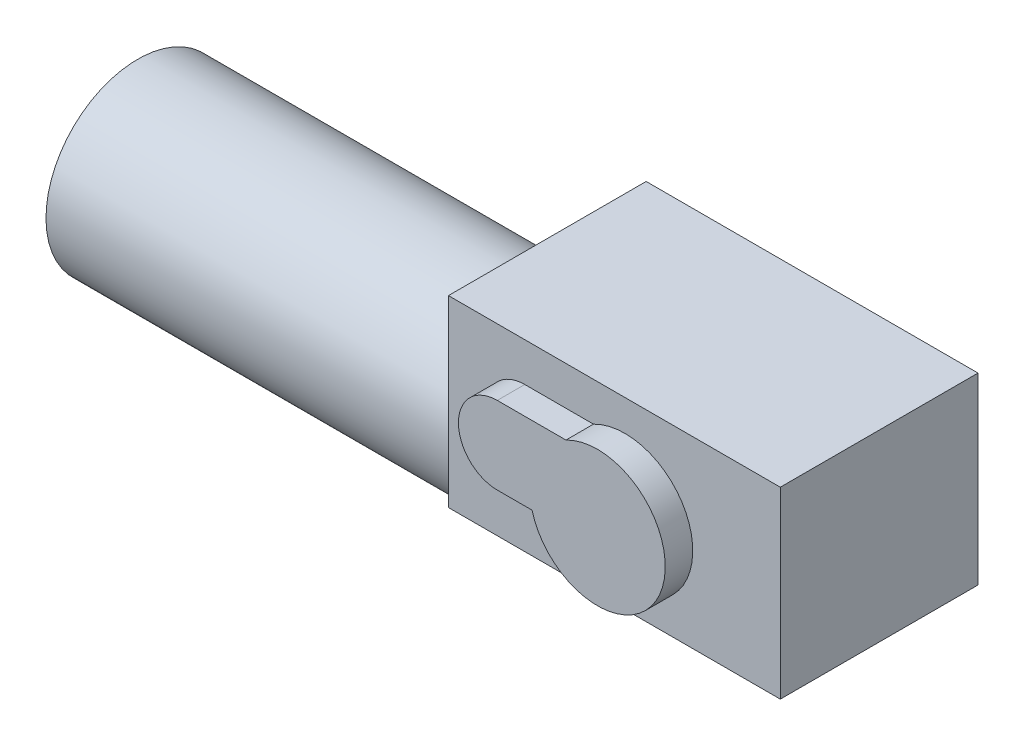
from build123d import *

# Parameters (mm, degrees)
SKETCH1_R           = 41.275
EXTRUDE1_DEPTH      = 184.15
EXTRUDE2_DEPTH      = 149.225
EXTRUDE3_DEPTH      = 56.8198
EXTRUDE3_DEPTH_BACK = 56.8198


with BuildPart() as part:
    # Sketch1 → Extrude1 (new body)
    with BuildSketch(Plane(origin=(0, 0, 0), x_dir=(0, 0, -1), z_dir=(1, 0, 0))):
        Circle(SKETCH1_R)
    extrude(amount=EXTRUDE1_DEPTH)

    # Sketch2 → Extrude2 (add)
    with BuildSketch(Plane(origin=(184.15, 0, 0), x_dir=(0, 0, -1), z_dir=(1, 0, 0))):
        Polygon((44.45, -19.05), (44.45, 63.5), (-44.45, 63.5), (-44.45, -19.05), (0, -19.05), align=None)
    extrude(amount=EXTRUDE2_DEPTH)

    # Sketch3 → Extrude3 (add, two sides: drawn at the far end of the back side and taken through both)
    with BuildSketch(Plane.XY.offset(-EXTRUDE3_DEPTH_BACK)):
        with BuildLine():
            Line((218.4781, 46.038114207), (249.35912228, 46.038114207))
            ThreePointArc((249.35912228, 46.038114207), (291.454741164, 6.845084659), (234.09683759, 11.111885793))
            Line((234.09683759, 11.111885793), (218.4781, 11.111885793))
            ThreePointArc((218.4781, 11.111885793), (201.014985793, 28.575), (218.4781, 46.038114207))
        make_face()
    extrude(amount=EXTRUDE3_DEPTH + EXTRUDE3_DEPTH_BACK)


solid = part.part
